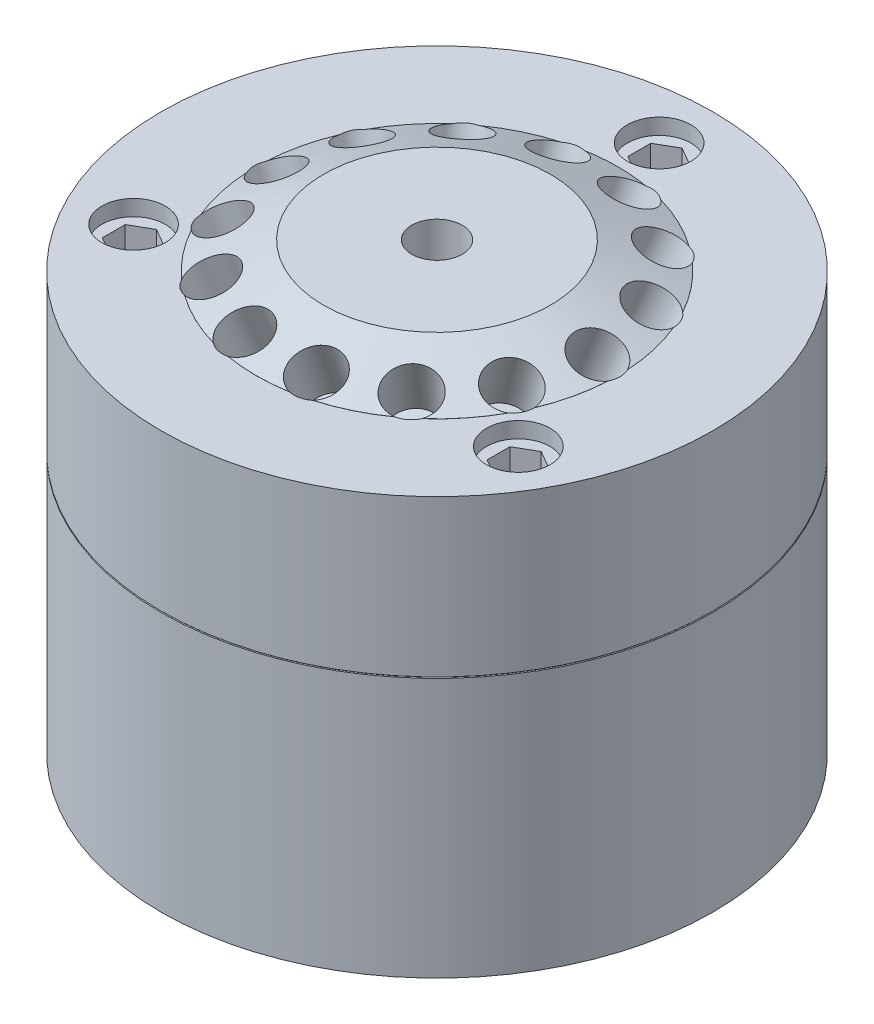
from build123d import *

# Parameters (mm, degrees)
EXTRUDE1_START          = 7.7216
SKETCH2_R               = 22.098
SKETCH2_R_2             = 14.478
EXTRUDE1_DEPTH          = 7.7216
SKETCH3_R               = 3.175
EXTRUDE2_DEPTH          = 11.1125
CUT_EXTRUDE1_DEPTH      = 48.723619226
CUT_EXTRUDE1_DEPTH_BACK = 48.723619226
SKETCH4_W               = 2.071690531
SKETCH4_H               = 5.044116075
EXTRUDE3_DEPTH          = 5.08
EXTRUDE3_DEPTH_BACK     = 9.525
SKETCH5_R               = 1.5875
SKETCH7_R               = 0.254
CUT_EXTRUDE2_DEPTH      = 35.56
SKETCH10_R              = 1.905
CUT_EXTRUDE3_DEPTH      = 6.35
CIRPATTERN1_COUNT       = 14
SKETCH11_R              = 2.54
CUT_EXTRUDE4_DEPTH      = 1.27
CUT_EXTRUDE5_DEPTH      = 3.81
CIRPATTERN2_COUNT       = 2


with BuildPart() as part:
    # Sketch1 → Revolve1 (revolve)
    with BuildSketch(Plane.XY, mode=Mode.PRIVATE) as revolve1_sk:
        Polygon((0, 0), (8.1026, 0), (8.1026, 0.508), (22.098, 0.508), (22.098, 21.2852), (22.0472, 21.336), (22.098, 21.3868), (22.098, 26.162), (14.478, 26.162), (14.478, 33.889192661), (9.0805, 36.068), (0, 36.068), align=None)
    revolve(revolve1_sk.sketch.rotate(Axis((0, -50.079896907, 0), (0, 1, 0)), 90), axis=Axis((0, -50.079896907, 0), (0, 1, 0)))

    # Sketch2 → Extrude1 (add)
    with BuildSketch(Plane(origin=(0, 26.162, 0), x_dir=(1, 0, 0), z_dir=(0, 1, 0)).offset(EXTRUDE1_START)):
        with Locations(Location((0, 0, 0), (0, 0, 90))):
            Circle(SKETCH2_R)
        with Locations(Location((0, 0, 0), (0, 0, 90))):
            Circle(SKETCH2_R_2, mode=Mode.SUBTRACT)
    extrude(amount=-EXTRUDE1_DEPTH)

    # Sketch6 → 10-32 Tapped Hole1 (revolve, cut)
    with BuildSketch(Plane(origin=(0, 36.068, 0), x_dir=(0, 0, 1), z_dir=(1, 0, 0))):
        Polygon((0, 0), (0, 13.252917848), (2.0193, 12.0396), (2.0193, 0), align=None)
    revolve(axis=Axis((0, 42.418, 0), (0, -1, 0)), mode=Mode.SUBTRACT)

    # Sketch7 → Cut-Extrude2 (cut)
    with BuildSketch(Plane(origin=(-14.419766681, 35.726074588, 0), x_dir=(-0.9273145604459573, -0.3742829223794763, 0), z_dir=(-0.37428292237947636, 0.9273145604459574, 0))):
        with Locations((-1.015156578, 0)):
            Circle(SKETCH7_R)
    cut_extrude2 = extrude(amount=-CUT_EXTRUDE2_DEPTH, mode=Mode.SUBTRACT)

    # Sketch8 → 75 _0.021_ Diameter Hole1 (revolve, cut)
    with BuildSketch(Plane(origin=(0, 36.068, 0), x_dir=(0, 0, 1), z_dir=(1, 0, 0))):
        Polygon((0, 0), (0, 36.736249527), (0.2667, 36.576), (0.2667, 0), align=None)
    revolve(axis=Axis((0, 42.418, 0), (0, -1, 0)), mode=Mode.SUBTRACT)

    # Sketch10 → Cut-Extrude3 (cut)
    with BuildSketch(Plane(origin=(-14.419766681, 35.726074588, 0), x_dir=(-0.9273145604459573, -0.3742829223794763, 0), z_dir=(-0.37428292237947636, 0.9273145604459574, 0))):
        with Locations((-1.015156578, 0)):
            Circle(SKETCH10_R)
    cut_extrude3 = extrude(amount=-CUT_EXTRUDE3_DEPTH, mode=Mode.SUBTRACT)

    # CirPattern1: Cut-Extrude2, Cut-Extrude3 ×14 about axis
    cirpattern1_axis = Axis((0, 0, 0), (0, 1, 0))
    add([cut_extrude2.rotate(cirpattern1_axis, i * 360 / CIRPATTERN1_COUNT) for i in range(1, CIRPATTERN1_COUNT)], mode=Mode.SUBTRACT)
    add([cut_extrude3.rotate(cirpattern1_axis, i * 360 / CIRPATTERN1_COUNT) for i in range(1, CIRPATTERN1_COUNT)], mode=Mode.SUBTRACT)

    # Sketch11 → Cut-Extrude4 (cut)
    with BuildSketch(Plane(origin=(0, 33.8836, 0), x_dir=(1, 0, 0), z_dir=(0, 1, 0))):
        with Locations(Location((0, 17.78, 0), (0, 0, 270))):
            Circle(SKETCH11_R)
        with Locations(Location((15.397931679, -8.89, 0), (0, 0, 270))):
            Circle(SKETCH11_R)
        with Locations(Location((-15.397931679, -8.89, 0), (0, 0, 270))):
            Circle(SKETCH11_R)
    extrude(amount=-CUT_EXTRUDE4_DEPTH, mode=Mode.SUBTRACT)

    # Sketch12 → Cut-Extrude5 (cut)
    with BuildSketch(Plane(origin=(0, 32.6136, 0), x_dir=(1, 0, 0), z_dir=(0, 1, 0))):
        Polygon((13.810431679, -7.973456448), (13.810431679, -9.806543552), (15.397931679, -10.723087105), (16.985431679, -9.806543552), (16.985431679, -7.973456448), (15.397931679, -7.056912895), align=None)
        Polygon((0, 19.613087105), (-1.5875, 18.696543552), (-1.5875, 16.863456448), (0, 15.946912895), (1.5875, 16.863456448), (1.5875, 18.696543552), align=None)
        Polygon((-13.810431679, -7.973456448), (-15.397931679, -7.056912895), (-16.985431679, -7.973456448), (-16.985431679, -9.806543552), (-15.397931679, -10.723087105), (-13.810431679, -9.806543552), align=None)
    extrude(amount=-CUT_EXTRUDE5_DEPTH, mode=Mode.SUBTRACT)

    # Sketch14 → 8-32 Tapped Hole1 (revolve, cut)
    with BuildSketch(Plane(origin=(-9.705326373, 0.508, 9.692022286), x_dir=(0, 0, -1), z_dir=(1, 0, 0))):
        Polygon((0, 0), (0, 13.331406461), (1.7272, 12.2936), (1.7272, 0), align=None)
    f_8_32_tapped_hole1 = revolve(axis=Axis((-9.705326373, -5.842, 9.692022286), (0, 1, 0)), mode=Mode.SUBTRACT)

    # CirPattern2: 8-32 Tapped Hole1 ×2 about axis
    cirpattern2_axis = Axis((0, 0, 0), (0, 1, 0))
    for i in range(1, CIRPATTERN2_COUNT):
        add(f_8_32_tapped_hole1.rotate(cirpattern2_axis, i * 360 / CIRPATTERN2_COUNT), mode=Mode.SUBTRACT)


with BuildPart() as body_2:
    # Sketch3 → Extrude2 (new body)
    with BuildSketch(Plane.XZ):
        with Locations(Location((0, 0, 0), (0, 0, 270))):
            Circle(SKETCH3_R)
    extrude(amount=EXTRUDE2_DEPTH)

    # Sketch4 → Cut-Extrude1 (cut, two sides: drawn at the far end of the back side and taken through both)
    with BuildSketch(Plane.XY.offset(-CUT_EXTRUDE1_DEPTH_BACK)):
        with Locations((3.448845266, -9.062558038)):
            Rectangle(SKETCH4_W, SKETCH4_H)
    extrude(amount=CUT_EXTRUDE1_DEPTH + CUT_EXTRUDE1_DEPTH_BACK, mode=Mode.SUBTRACT)


with BuildPart() as body_3:
    # Sketch5 → Extrude3 (new, two sides: drawn at the far end of the back side and taken through both)
    with BuildSketch(Plane(origin=(2.413, 0, 0), x_dir=(0, 0, -1), z_dir=(1, 0, 0)).offset(-EXTRUDE3_DEPTH_BACK)):
        with Locations(Location((0, -8.509, 0), (0, 0, 90))):
            Circle(SKETCH5_R)
    extrude(amount=EXTRUDE3_DEPTH + EXTRUDE3_DEPTH_BACK)


solid = Compound([part.part, body_2.part, body_3.part])
